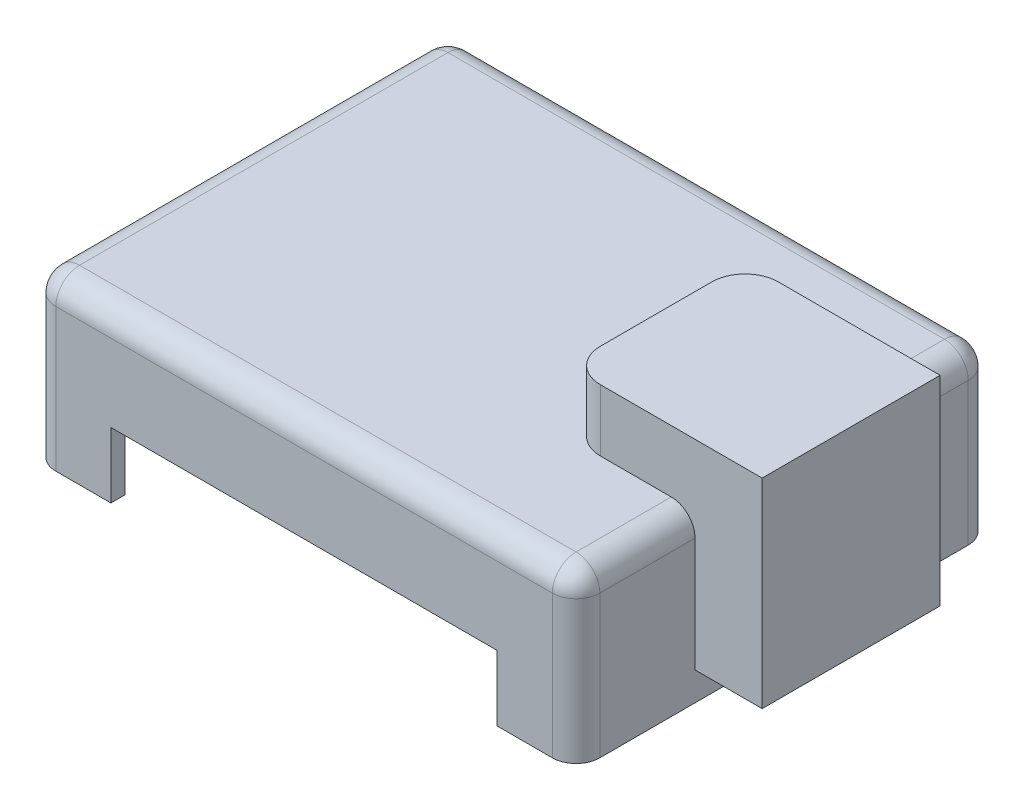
from build123d import *

# Parameters (mm, degrees)
SKETCH1_W           = 114.414824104
SKETCH1_H           = 87.46556634
EXTRUDE1_DEPTH      = 35
FILLET1_R           = 5
SHELL1_T            = -3
CUT_EXTRUDE1_REACH  = 112.218
SKETCH2_W           = 81.2392839
SKETCH2_H           = 13.760953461
EXTRUDE2_DEPTH      = 13
EXTRUDE2_DEPTH_BACK = 29


with BuildPart() as part:
    # Sketch1 → Extrude1 (new body)
    with BuildSketch(Plane(origin=(0, 0, 0), x_dir=(1, 0, 0), z_dir=(0, 1, 0))):
        Rectangle(SKETCH1_W, SKETCH1_H)
    extrude(amount=EXTRUDE1_DEPTH)

    # Fillet1
    fillet1_edges = [part.edges().sort_by_distance(p)[0] for p in [
        (57.207412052, 35, 0),
        (0, 35, -43.73278317),
        (-57.207412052, 35, 0),
        (0, 35, 43.73278317),
        (-57.207412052, 17.5, -43.73278317),
        (57.207412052, 17.5, -43.73278317),
        (57.207412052, 17.5, 43.73278317),
        (-57.207412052, 17.5, 43.73278317),
    ]]
    fillet(fillet1_edges, radius=FILLET1_R)

    # Shell1
    shell1_openings = [part.faces().sort_by_distance(p)[0] for p in [
        (0, 0, 0),
    ]]
    offset(amount=SHELL1_T, openings=shell1_openings, kind=Kind.INTERSECTION)

    # Sketch2 → Cut-Extrude1 (cut, up to next)
    with BuildSketch(Plane.XY.offset(43.73278317), mode=Mode.PRIVATE) as cut_extrude1_sk1:
        with Locations((0, 6.880476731)):
            Rectangle(SKETCH2_W, SKETCH2_H)
    cut_extrude1_tool1 = extrude(cut_extrude1_sk1.sketch, amount=-CUT_EXTRUDE1_REACH, mode=Mode.PRIVATE) & part.part
    add(cut_extrude1_tool1.solids().sort_by_distance((0, 6.880477, 43.732783))[0], mode=Mode.SUBTRACT)


with BuildPart() as body_2:
    # Sketch3 → Extrude2 (new, two sides: drawn at the far end of the back side and taken through both)
    with BuildSketch(Plane(origin=(0, 35, 0), x_dir=(-1, 0, 0), z_dir=(0, 1, 0)).offset(-EXTRUDE2_DEPTH_BACK)):
        with BuildLine():
            Line((-37.300639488, -18.713046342), (-71.318404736, -18.713046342))
            Line((-71.318404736, -18.713046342), (-71.318404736, 18.713046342))
            Line((-71.318404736, 18.713046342), (-37.300639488, 18.713046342))
            ThreePointArc((-37.300639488, 18.713046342), (-32.35089202, 16.662793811), (-30.300639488, 11.713046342))
            Line((-30.300639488, 11.713046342), (-30.300639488, -11.713046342))
            ThreePointArc((-30.300639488, -11.713046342), (-32.35089202, -16.662793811), (-37.300639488, -18.713046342))
        make_face()
    extrude(amount=EXTRUDE2_DEPTH + EXTRUDE2_DEPTH_BACK)


solid = Compound([part.part, body_2.part])
